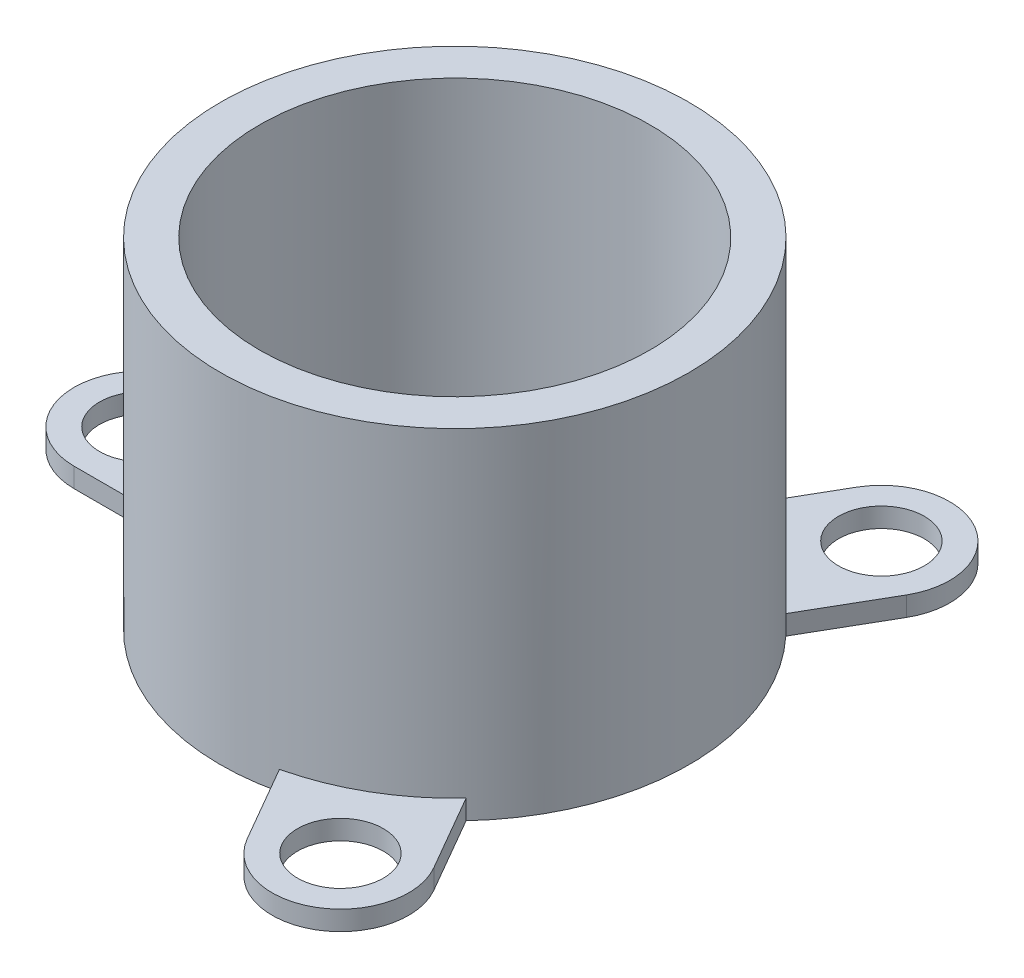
from build123d import *

# Parameters (mm, degrees)
SKETCH1_R           = 60
SKETCH1_R_2         = 50
EXTRUDE_THIN1_DEPTH = 87
SKETCH2_R           = 11
BOSS_EXTRUDE1_DEPTH = 5
CIRPATTERN1_COUNT   = 3


with BuildPart() as part:
    # Sketch1 → Extrude-Thin1 (new body)
    with BuildSketch(Plane(origin=(0, 0, 0), x_dir=(1, 0, 0), z_dir=(0, 1, 0))):
        Circle(SKETCH1_R)
        Circle(SKETCH1_R_2, mode=Mode.SUBTRACT)
    extrude(amount=EXTRUDE_THIN1_DEPTH)

    # Sketch2 → Boss-Extrude1 (add)
    with BuildSketch(Plane.XZ):
        with BuildLine():
            Line((-57.391201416, 17.5), (-80, 17.5))
            ThreePointArc((-80, 17.5), (-97.5, 0), (-80, -17.5))
            Line((-80, -17.5), (-57.391201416, -17.5))
            ThreePointArc((-57.391201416, -17.5), (-60, 0), (-57.391201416, 17.5))
        make_face()
        with Locations(Location((-80, 0, 0), (0, 0, 270))):
            Circle(SKETCH2_R, mode=Mode.SUBTRACT)
    boss_extrude1 = extrude(amount=-BOSS_EXTRUDE1_DEPTH)

    # CirPattern1: Boss-Extrude1 ×3 about axis
    cirpattern1_axis = Axis((0, 0, 0), (0, 1, 0))
    for i in range(1, CIRPATTERN1_COUNT):
        add(boss_extrude1.rotate(cirpattern1_axis, i * 360 / CIRPATTERN1_COUNT))


solid = part.part
